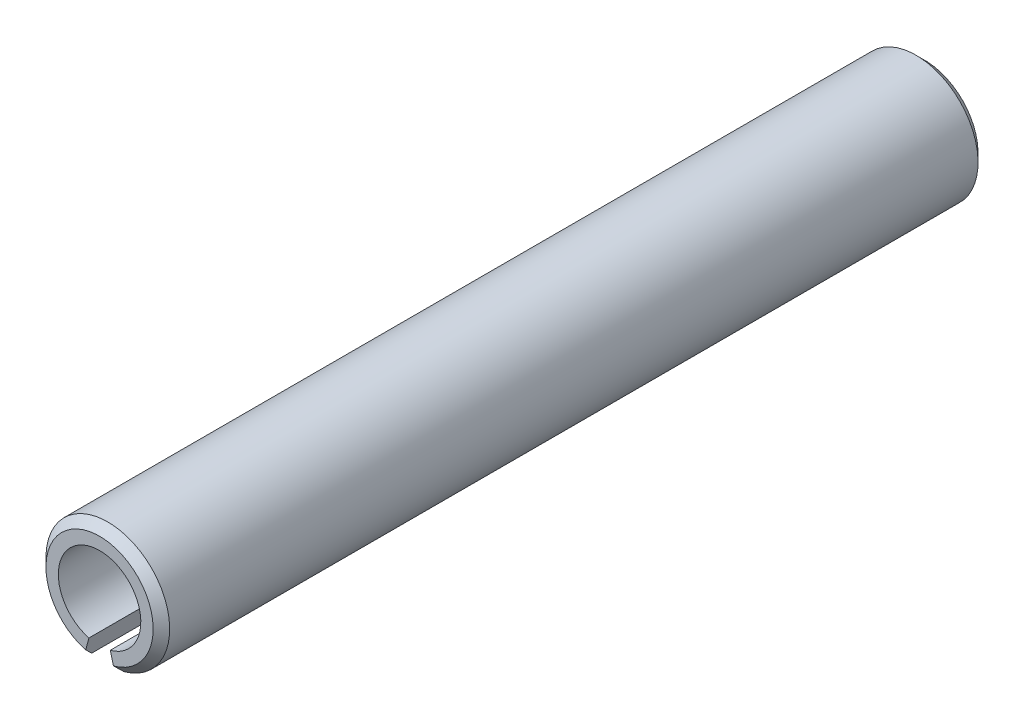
from build123d import *

# Parameters (mm, degrees)
BASE_EXTRUSION_DEPTH = 20
CHANFREIN1_SIZE      = 0.2


with BuildPart() as part:
    # Esquisse1 → Base-Extrusion (new body)
    with BuildSketch(Plane.XY):
        with BuildLine():
            Line((-0.258819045, -0.965925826), (-0.388228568, -1.448888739))
            ThreePointArc((-0.388228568, -1.448888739), (0, 1.5), (0.388228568, -1.448888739))
            Line((0.388228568, -1.448888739), (0.258819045, -0.965925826))
            ThreePointArc((0.258819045, -0.965925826), (0, 1), (-0.258819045, -0.965925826))
        make_face()
    extrude(amount=BASE_EXTRUSION_DEPTH)

    # Chanfrein1
    chanfrein1_edges = [part.edges().sort_by_distance(p)[0] for p in [
        (0, 1.5, 0),
        (0, 1.5, 20),
    ]]
    chamfer(chanfrein1_edges, length=CHANFREIN1_SIZE)


solid = part.part
